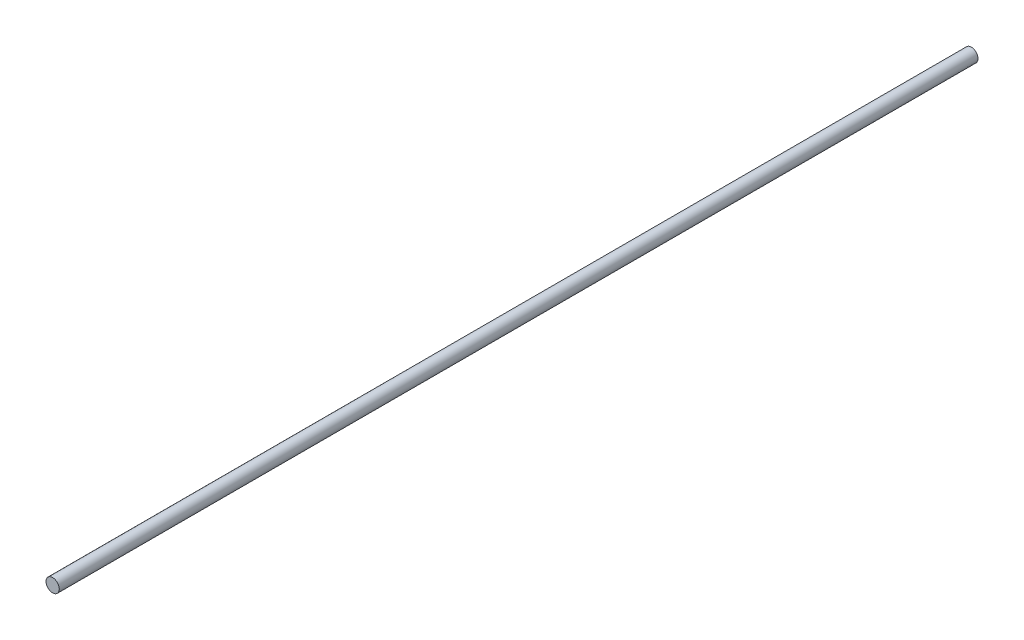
ISO-10303-21;
HEADER;
FILE_DESCRIPTION(('STEP AP214'),'2;1');
FILE_NAME('part.step','',(''),(''),'','','');
FILE_SCHEMA(('AUTOMOTIVE_DESIGN { 1 0 10303 214 1 1 1 1 }'));
ENDSEC;
DATA;
#1=APPLICATION_CONTEXT('core data for automotive mechanical design processes');
#2=APPLICATION_PROTOCOL_DEFINITION('international standard','automotive_design',2000,#1);
#3=PRODUCT_CONTEXT('',#1,'mechanical');
#4=PRODUCT('Part','Part','',(#3));
#5=PRODUCT_RELATED_PRODUCT_CATEGORY('part','',(#4));
#6=PRODUCT_DEFINITION_FORMATION('','',#4);
#7=PRODUCT_DEFINITION_CONTEXT('part definition',#1,'design');
#8=PRODUCT_DEFINITION('design','',#6,#7);
#9=PRODUCT_DEFINITION_SHAPE('','',#8);
#10=(LENGTH_UNIT() NAMED_UNIT(*) SI_UNIT(.MILLI.,.METRE.));
#11=(NAMED_UNIT(*) PLANE_ANGLE_UNIT() SI_UNIT($,.RADIAN.));
#12=(NAMED_UNIT(*) SI_UNIT($,.STERADIAN.) SOLID_ANGLE_UNIT());
#13=UNCERTAINTY_MEASURE_WITH_UNIT(LENGTH_MEASURE(1.E-05),#10,'distance_accuracy_value','');
#14=(GEOMETRIC_REPRESENTATION_CONTEXT(3) GLOBAL_UNCERTAINTY_ASSIGNED_CONTEXT((#13)) GLOBAL_UNIT_ASSIGNED_CONTEXT((#10,
#11,#12)) REPRESENTATION_CONTEXT('',''));
#15=CARTESIAN_POINT('',(0.,0.,0.));
#16=DIRECTION('',(0.,0.,1.));
#17=DIRECTION('',(1.,0.,0.));
#18=AXIS2_PLACEMENT_3D('',#15,#16,#17);
#19=CARTESIAN_POINT('',(0.,0.,-4150.));
#20=DIRECTION('',(0.,0.,1.));
#21=DIRECTION('',(1.,0.,0.));
#22=AXIS2_PLACEMENT_3D('',#19,#20,#21);
#23=CYLINDRICAL_SURFACE('',#22,30.);
#24=CARTESIAN_POINT('',(0.,0.,-4150.));
#25=DIRECTION('',(0.,0.,1.));
#26=DIRECTION('',(1.,0.,0.));
#27=AXIS2_PLACEMENT_3D('',#24,#25,#26);
#28=CIRCLE('',#27,30.);
#29=CARTESIAN_POINT('',(30.,0.,-4150.));
#30=VERTEX_POINT('',#29);
#31=EDGE_CURVE('E10',#30,#30,#28,.T.);
#32=ORIENTED_EDGE('',*,*,#31,.T.);
#33=EDGE_LOOP('',(#32));
#34=FACE_BOUND('',#33,.T.);
#35=CARTESIAN_POINT('',(0.,0.,0.));
#36=DIRECTION('',(0.,0.,1.));
#37=DIRECTION('',(1.,0.,0.));
#38=AXIS2_PLACEMENT_3D('',#35,#36,#37);
#39=CIRCLE('',#38,30.);
#40=CARTESIAN_POINT('',(30.,0.,0.));
#41=VERTEX_POINT('',#40);
#42=EDGE_CURVE('E40',#41,#41,#39,.T.);
#43=ORIENTED_EDGE('',*,*,#42,.F.);
#44=EDGE_LOOP('',(#43));
#45=FACE_BOUND('',#44,.T.);
#46=ADVANCED_FACE('F37',(#34,#45),#23,.T.);
#47=CARTESIAN_POINT('',(0.,0.,-4150.));
#48=DIRECTION('',(0.,0.,1.));
#49=DIRECTION('',(1.,0.,0.));
#50=AXIS2_PLACEMENT_3D('',#47,#48,#49);
#51=PLANE('',#50);
#52=ORIENTED_EDGE('',*,*,#31,.F.);
#53=EDGE_LOOP('',(#52));
#54=FACE_BOUND('',#53,.T.);
#55=ADVANCED_FACE('F54',(#54),#51,.F.);
#56=CARTESIAN_POINT('',(0.,0.,0.));
#57=DIRECTION('',(0.,0.,1.));
#58=DIRECTION('',(1.,0.,0.));
#59=AXIS2_PLACEMENT_3D('',#56,#57,#58);
#60=PLANE('',#59);
#61=ORIENTED_EDGE('',*,*,#42,.T.);
#62=EDGE_LOOP('',(#61));
#63=FACE_BOUND('',#62,.T.);
#64=ADVANCED_FACE('F51',(#63),#60,.T.);
#65=CLOSED_SHELL('',(#46,#55,#64));
#66=MANIFOLD_SOLID_BREP('B2',#65);
#67=ADVANCED_BREP_SHAPE_REPRESENTATION('',(#18,#66),#14);
#68=SHAPE_DEFINITION_REPRESENTATION(#9,#67);
ENDSEC;
END-ISO-10303-21;
